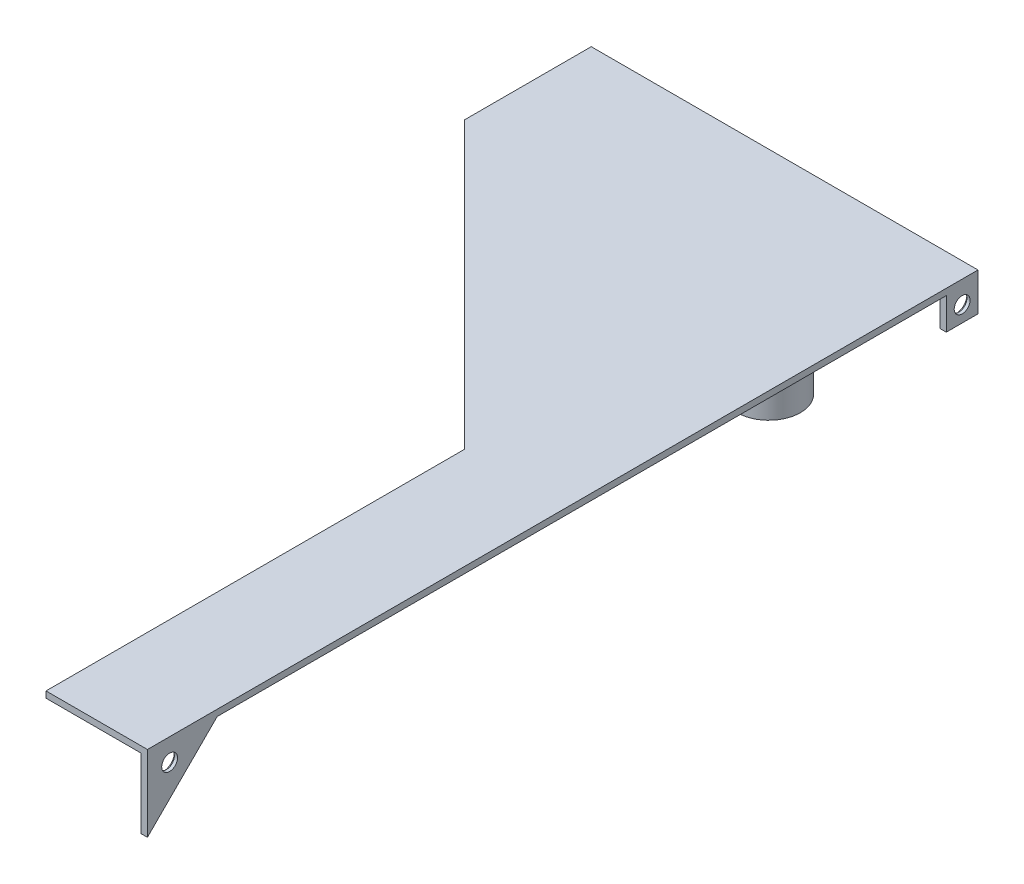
ISO-10303-21;
HEADER;
FILE_DESCRIPTION(('STEP AP214'),'2;1');
FILE_NAME('part.step','',(''),(''),'','','');
FILE_SCHEMA(('AUTOMOTIVE_DESIGN { 1 0 10303 214 1 1 1 1 }'));
ENDSEC;
DATA;
#1=APPLICATION_CONTEXT('core data for automotive mechanical design processes');
#2=APPLICATION_PROTOCOL_DEFINITION('international standard','automotive_design',2000,#1);
#3=PRODUCT_CONTEXT('',#1,'mechanical');
#4=PRODUCT('Part','Part','',(#3));
#5=PRODUCT_RELATED_PRODUCT_CATEGORY('part','',(#4));
#6=PRODUCT_DEFINITION_FORMATION('','',#4);
#7=PRODUCT_DEFINITION_CONTEXT('part definition',#1,'design');
#8=PRODUCT_DEFINITION('design','',#6,#7);
#9=PRODUCT_DEFINITION_SHAPE('','',#8);
#10=(LENGTH_UNIT() NAMED_UNIT(*) SI_UNIT(.MILLI.,.METRE.));
#11=(NAMED_UNIT(*) PLANE_ANGLE_UNIT() SI_UNIT($,.RADIAN.));
#12=(NAMED_UNIT(*) SI_UNIT($,.STERADIAN.) SOLID_ANGLE_UNIT());
#13=UNCERTAINTY_MEASURE_WITH_UNIT(LENGTH_MEASURE(1.E-05),#10,'distance_accuracy_value','');
#14=(GEOMETRIC_REPRESENTATION_CONTEXT(3) GLOBAL_UNCERTAINTY_ASSIGNED_CONTEXT((#13)) GLOBAL_UNIT_ASSIGNED_CONTEXT((#10,
#11,#12)) REPRESENTATION_CONTEXT('',''));
#15=CARTESIAN_POINT('',(0.,0.,0.));
#16=DIRECTION('',(0.,0.,1.));
#17=DIRECTION('',(1.,0.,0.));
#18=AXIS2_PLACEMENT_3D('',#15,#16,#17);
#19=CARTESIAN_POINT('',(0.,0.,0.));
#20=DIRECTION('',(-1.,0.,0.));
#21=DIRECTION('',(0.,0.,1.));
#22=AXIS2_PLACEMENT_3D('',#19,#20,#21);
#23=PLANE('',#22);
#24=DIRECTION('',(0.,-0.707106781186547,0.707106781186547));
#25=VECTOR('',#24,1.);
#26=CARTESIAN_POINT('',(0.,259.08,244.895433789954));
#27=LINE('',#26,#25);
#28=CARTESIAN_POINT('',(0.,259.08,244.895433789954));
#29=VERTEX_POINT('',#28);
#30=CARTESIAN_POINT('',(0.,231.139999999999,272.835433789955));
#31=VERTEX_POINT('',#30);
#32=EDGE_CURVE('E132',#29,#31,#27,.T.);
#33=ORIENTED_EDGE('',*,*,#32,.T.);
#34=DIRECTION('',(0.,-1.,0.));
#35=VECTOR('',#34,1.);
#36=CARTESIAN_POINT('',(0.,2.53999999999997,272.835433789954));
#37=LINE('',#36,#35);
#38=CARTESIAN_POINT('',(0.,259.08,272.835433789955));
#39=VERTEX_POINT('',#38);
#40=EDGE_CURVE('E141',#39,#31,#37,.T.);
#41=ORIENTED_EDGE('',*,*,#40,.F.);
#42=DIRECTION('',(0.,0.,-1.));
#43=VECTOR('',#42,1.);
#44=CARTESIAN_POINT('',(0.,259.08,272.835433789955));
#45=LINE('',#44,#43);
#46=EDGE_CURVE('E255',#39,#29,#45,.T.);
#47=ORIENTED_EDGE('',*,*,#46,.T.);
#48=EDGE_LOOP('',(#33,#41,#47));
#49=FACE_BOUND('',#48,.T.);
#50=CARTESIAN_POINT('',(0.,252.73,263.945433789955));
#51=DIRECTION('',(-1.,0.,0.));
#52=DIRECTION('',(0.,0.,1.));
#53=AXIS2_PLACEMENT_3D('',#50,#51,#52);
#54=CIRCLE('',#53,4.44500000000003);
#55=CARTESIAN_POINT('',(0.,252.73,268.390433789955));
#56=VERTEX_POINT('',#55);
#57=EDGE_CURVE('E177',#56,#56,#54,.F.);
#58=ORIENTED_EDGE('',*,*,#57,.T.);
#59=EDGE_LOOP('',(#58));
#60=FACE_BOUND('',#59,.T.);
#61=ADVANCED_FACE('F34',(#49,#60),#23,.T.);
#62=CARTESIAN_POINT('',(0.,0.,272.835433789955));
#63=DIRECTION('',(0.,0.,1.));
#64=DIRECTION('',(1.,0.,0.));
#65=AXIS2_PLACEMENT_3D('',#62,#63,#64);
#66=PLANE('',#65);
#67=DIRECTION('',(-1.,0.,0.));
#68=VECTOR('',#67,1.);
#69=CARTESIAN_POINT('',(0.,231.139999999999,272.835433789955));
#70=LINE('',#69,#68);
#71=CARTESIAN_POINT('',(2.54,231.139999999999,272.835433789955));
#72=VERTEX_POINT('',#71);
#73=EDGE_CURVE('E125',#72,#31,#70,.T.);
#74=ORIENTED_EDGE('',*,*,#73,.F.);
#75=DIRECTION('',(0.,-1.,0.));
#76=VECTOR('',#75,1.);
#77=CARTESIAN_POINT('',(2.54,2.53999999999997,272.835433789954));
#78=LINE('',#77,#76);
#79=CARTESIAN_POINT('',(2.54,261.62,272.835433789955));
#80=VERTEX_POINT('',#79);
#81=EDGE_CURVE('E137',#80,#72,#78,.T.);
#82=ORIENTED_EDGE('',*,*,#81,.F.);
#83=DIRECTION('',(-1.,0.,0.));
#84=VECTOR('',#83,1.);
#85=CARTESIAN_POINT('',(43.18,261.62,272.835433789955));
#86=LINE('',#85,#84);
#87=CARTESIAN_POINT('',(-38.1,261.62,272.835433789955));
#88=VERTEX_POINT('',#87);
#89=EDGE_CURVE('E158',#80,#88,#86,.T.);
#90=ORIENTED_EDGE('',*,*,#89,.T.);
#91=DIRECTION('',(0.,1.,0.));
#92=VECTOR('',#91,1.);
#93=CARTESIAN_POINT('',(-38.1,259.08,272.835433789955));
#94=LINE('',#93,#92);
#95=CARTESIAN_POINT('',(-38.1,259.08,272.835433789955));
#96=VERTEX_POINT('',#95);
#97=EDGE_CURVE('E269',#96,#88,#94,.T.);
#98=ORIENTED_EDGE('',*,*,#97,.F.);
#99=DIRECTION('',(1.,0.,0.));
#100=VECTOR('',#99,1.);
#101=CARTESIAN_POINT('',(0.,259.08,272.835433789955));
#102=LINE('',#101,#100);
#103=EDGE_CURVE('E262',#96,#39,#102,.T.);
#104=ORIENTED_EDGE('',*,*,#103,.T.);
#105=ORIENTED_EDGE('',*,*,#40,.T.);
#106=EDGE_LOOP('',(#74,#82,#90,#98,#104,#105));
#107=FACE_BOUND('',#106,.T.);
#108=ADVANCED_FACE('F136',(#107),#66,.T.);
#109=CARTESIAN_POINT('',(2.54,0.,-34.5045662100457));
#110=DIRECTION('',(1.,0.,0.));
#111=DIRECTION('',(0.,0.,-1.));
#112=AXIS2_PLACEMENT_3D('',#109,#110,#111);
#113=PLANE('',#112);
#114=ORIENTED_EDGE('',*,*,#81,.T.);
#115=DIRECTION('',(0.,-0.707106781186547,0.707106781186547));
#116=VECTOR('',#115,1.);
#117=CARTESIAN_POINT('',(2.54,259.08,244.895433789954));
#118=LINE('',#117,#116);
#119=CARTESIAN_POINT('',(2.54,259.08,244.895433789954));
#120=VERTEX_POINT('',#119);
#121=EDGE_CURVE('E121',#120,#72,#118,.T.);
#122=ORIENTED_EDGE('',*,*,#121,.F.);
#123=DIRECTION('',(0.,0.,1.));
#124=VECTOR('',#123,1.);
#125=CARTESIAN_POINT('',(2.54,259.08,230.925433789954));
#126=LINE('',#125,#124);
#127=CARTESIAN_POINT('',(2.54,259.08,-47.2045662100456));
#128=VERTEX_POINT('',#127);
#129=EDGE_CURVE('E149',#128,#120,#126,.T.);
#130=ORIENTED_EDGE('',*,*,#129,.F.);
#131=DIRECTION('',(0.,-1.,0.));
#132=VECTOR('',#131,1.);
#133=CARTESIAN_POINT('',(2.54,259.08,-47.2045662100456));
#134=LINE('',#133,#132);
#135=CARTESIAN_POINT('',(2.54,246.38,-47.2045662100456));
#136=VERTEX_POINT('',#135);
#137=EDGE_CURVE('E247',#128,#136,#134,.T.);
#138=ORIENTED_EDGE('',*,*,#137,.T.);
#139=DIRECTION('',(0.,0.,-1.));
#140=VECTOR('',#139,1.);
#141=CARTESIAN_POINT('',(2.54,246.38,-59.9045662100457));
#142=LINE('',#141,#140);
#143=CARTESIAN_POINT('',(2.54,246.38,-59.9045662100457));
#144=VERTEX_POINT('',#143);
#145=EDGE_CURVE('E229',#136,#144,#142,.T.);
#146=ORIENTED_EDGE('',*,*,#145,.T.);
#147=DIRECTION('',(0.,1.,0.));
#148=VECTOR('',#147,1.);
#149=CARTESIAN_POINT('',(2.54,259.08,-59.9045662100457));
#150=LINE('',#149,#148);
#151=CARTESIAN_POINT('',(2.54,261.62,-59.9045662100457));
#152=VERTEX_POINT('',#151);
#153=EDGE_CURVE('E264',#144,#152,#150,.T.);
#154=ORIENTED_EDGE('',*,*,#153,.T.);
#155=DIRECTION('',(0.,0.,-1.));
#156=VECTOR('',#155,1.);
#157=CARTESIAN_POINT('',(2.54,261.62,7.07767178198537E-13));
#158=LINE('',#157,#156);
#159=EDGE_CURVE('E148',#80,#152,#158,.T.);
#160=ORIENTED_EDGE('',*,*,#159,.F.);
#161=EDGE_LOOP('',(#114,#122,#130,#138,#146,#154,#160));
#162=FACE_BOUND('',#161,.T.);
#163=CARTESIAN_POINT('',(2.54,252.73,-53.5545662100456));
#164=DIRECTION('',(1.,0.,0.));
#165=DIRECTION('',(0.,0.,-1.));
#166=AXIS2_PLACEMENT_3D('',#163,#164,#165);
#167=CIRCLE('',#166,3.175);
#168=CARTESIAN_POINT('',(2.54,252.73,-56.7295662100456));
#169=VERTEX_POINT('',#168);
#170=EDGE_CURVE('E142',#169,#169,#167,.T.);
#171=ORIENTED_EDGE('',*,*,#170,.F.);
#172=EDGE_LOOP('',(#171));
#173=FACE_BOUND('',#172,.T.);
#174=CARTESIAN_POINT('',(2.54,252.73,263.945433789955));
#175=DIRECTION('',(1.,0.,0.));
#176=DIRECTION('',(0.,0.,-1.));
#177=AXIS2_PLACEMENT_3D('',#174,#175,#176);
#178=CIRCLE('',#177,3.17499999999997);
#179=CARTESIAN_POINT('',(2.54,252.73,260.770433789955));
#180=VERTEX_POINT('',#179);
#181=EDGE_CURVE('E250',#180,#180,#178,.T.);
#182=ORIENTED_EDGE('',*,*,#181,.F.);
#183=EDGE_LOOP('',(#182));
#184=FACE_BOUND('',#183,.T.);
#185=ADVANCED_FACE('F145',(#162,#173,#184),#113,.T.);
#186=CARTESIAN_POINT('',(2.54,259.08,244.895433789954));
#187=DIRECTION('',(0.,-0.707106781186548,-0.707106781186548));
#188=DIRECTION('',(0.,0.707106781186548,-0.707106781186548));
#189=AXIS2_PLACEMENT_3D('',#186,#187,#188);
#190=PLANE('',#189);
#191=ORIENTED_EDGE('',*,*,#121,.T.);
#192=ORIENTED_EDGE('',*,*,#73,.T.);
#193=ORIENTED_EDGE('',*,*,#32,.F.);
#194=DIRECTION('',(-1.,0.,0.));
#195=VECTOR('',#194,1.);
#196=CARTESIAN_POINT('',(2.54,259.08,244.895433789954));
#197=LINE('',#196,#195);
#198=EDGE_CURVE('E128',#120,#29,#197,.T.);
#199=ORIENTED_EDGE('',*,*,#198,.F.);
#200=EDGE_LOOP('',(#191,#192,#193,#199));
#201=FACE_BOUND('',#200,.T.);
#202=ADVANCED_FACE('F123',(#201),#190,.T.);
#203=CARTESIAN_POINT('',(-152.4,259.08,-9.10456621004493));
#204=DIRECTION('',(0.707106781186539,0.,-0.707106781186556));
#205=DIRECTION('',(-0.707106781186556,0.,-0.707106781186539));
#206=AXIS2_PLACEMENT_3D('',#203,#204,#205);
#207=PLANE('',#206);
#208=DIRECTION('',(-0.707106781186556,0.,-0.707106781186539));
#209=VECTOR('',#208,1.);
#210=CARTESIAN_POINT('',(-152.4,259.08,-9.10456621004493));
#211=LINE('',#210,#209);
#212=CARTESIAN_POINT('',(-38.1,259.08,105.195433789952));
#213=VERTEX_POINT('',#212);
#214=CARTESIAN_POINT('',(-152.4,259.08,-9.10456621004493));
#215=VERTEX_POINT('',#214);
#216=EDGE_CURVE('E58',#213,#215,#211,.T.);
#217=ORIENTED_EDGE('',*,*,#216,.F.);
#218=DIRECTION('',(0.,1.,0.));
#219=VECTOR('',#218,1.);
#220=CARTESIAN_POINT('',(-38.1,259.08,105.195433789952));
#221=LINE('',#220,#219);
#222=CARTESIAN_POINT('',(-38.1,261.62,105.195433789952));
#223=VERTEX_POINT('',#222);
#224=EDGE_CURVE('E152',#213,#223,#221,.T.);
#225=ORIENTED_EDGE('',*,*,#224,.T.);
#226=DIRECTION('',(-0.707106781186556,0.,-0.707106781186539));
#227=VECTOR('',#226,1.);
#228=CARTESIAN_POINT('',(-152.4,261.62,-9.10456621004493));
#229=LINE('',#228,#227);
#230=CARTESIAN_POINT('',(-152.4,261.62,-9.10456621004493));
#231=VERTEX_POINT('',#230);
#232=EDGE_CURVE('E163',#223,#231,#229,.T.);
#233=ORIENTED_EDGE('',*,*,#232,.T.);
#234=DIRECTION('',(0.,1.,0.));
#235=VECTOR('',#234,1.);
#236=CARTESIAN_POINT('',(-152.4,259.08,-9.10456621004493));
#237=LINE('',#236,#235);
#238=EDGE_CURVE('E165',#215,#231,#237,.T.);
#239=ORIENTED_EDGE('',*,*,#238,.F.);
#240=EDGE_LOOP('',(#217,#225,#233,#239));
#241=FACE_BOUND('',#240,.T.);
#242=ADVANCED_FACE('F278',(#241),#207,.F.);
#243=CARTESIAN_POINT('',(-152.4,259.08,-34.5045662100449));
#244=DIRECTION('',(1.,0.,0.));
#245=DIRECTION('',(0.,0.,-1.));
#246=AXIS2_PLACEMENT_3D('',#243,#244,#245);
#247=PLANE('',#246);
#248=DIRECTION('',(0.,0.,-1.));
#249=VECTOR('',#248,1.);
#250=CARTESIAN_POINT('',(-152.4,261.62,-34.5045662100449));
#251=LINE('',#250,#249);
#252=CARTESIAN_POINT('',(-152.4,261.62,-59.9045662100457));
#253=VERTEX_POINT('',#252);
#254=EDGE_CURVE('E160',#231,#253,#251,.T.);
#255=ORIENTED_EDGE('',*,*,#254,.T.);
#256=DIRECTION('',(0.,1.,0.));
#257=VECTOR('',#256,1.);
#258=CARTESIAN_POINT('',(-152.4,259.08,-59.9045662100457));
#259=LINE('',#258,#257);
#260=CARTESIAN_POINT('',(-152.4,259.08,-59.9045662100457));
#261=VERTEX_POINT('',#260);
#262=EDGE_CURVE('E272',#261,#253,#259,.T.);
#263=ORIENTED_EDGE('',*,*,#262,.F.);
#264=DIRECTION('',(0.,0.,-1.));
#265=VECTOR('',#264,1.);
#266=CARTESIAN_POINT('',(-152.4,259.08,-34.5045662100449));
#267=LINE('',#266,#265);
#268=EDGE_CURVE('E161',#215,#261,#267,.T.);
#269=ORIENTED_EDGE('',*,*,#268,.F.);
#270=ORIENTED_EDGE('',*,*,#238,.T.);
#271=EDGE_LOOP('',(#255,#263,#269,#270));
#272=FACE_BOUND('',#271,.T.);
#273=ADVANCED_FACE('F287',(#272),#247,.F.);
#274=CARTESIAN_POINT('',(0.,261.62,7.07767178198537E-13));
#275=DIRECTION('',(0.,1.,0.));
#276=DIRECTION('',(0.,0.,1.));
#277=AXIS2_PLACEMENT_3D('',#274,#275,#276);
#278=PLANE('',#277);
#279=ORIENTED_EDGE('',*,*,#232,.F.);
#280=DIRECTION('',(0.,0.,1.));
#281=VECTOR('',#280,1.);
#282=CARTESIAN_POINT('',(-38.1,261.62,272.835433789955));
#283=LINE('',#282,#281);
#284=EDGE_CURVE('E258',#223,#88,#283,.T.);
#285=ORIENTED_EDGE('',*,*,#284,.T.);
#286=ORIENTED_EDGE('',*,*,#89,.F.);
#287=ORIENTED_EDGE('',*,*,#159,.T.);
#288=DIRECTION('',(-1.,0.,0.));
#289=VECTOR('',#288,1.);
#290=CARTESIAN_POINT('',(2.54,261.62,-59.9045662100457));
#291=LINE('',#290,#289);
#292=EDGE_CURVE('E253',#152,#253,#291,.T.);
#293=ORIENTED_EDGE('',*,*,#292,.T.);
#294=ORIENTED_EDGE('',*,*,#254,.F.);
#295=EDGE_LOOP('',(#279,#285,#286,#287,#293,#294));
#296=FACE_BOUND('',#295,.T.);
#297=ADVANCED_FACE('F283',(#296),#278,.T.);
#298=CARTESIAN_POINT('',(0.,259.08,7.07767178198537E-13));
#299=DIRECTION('',(0.,1.,0.));
#300=DIRECTION('',(0.,0.,1.));
#301=AXIS2_PLACEMENT_3D('',#298,#299,#300);
#302=PLANE('',#301);
#303=CARTESIAN_POINT('',(-27.94,259.08,-6.56456621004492));
#304=DIRECTION('',(0.,1.,0.));
#305=DIRECTION('',(0.,0.,1.));
#306=AXIS2_PLACEMENT_3D('',#303,#304,#305);
#307=CIRCLE('',#306,12.7);
#308=CARTESIAN_POINT('',(-27.94,259.08,6.13543378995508));
#309=VERTEX_POINT('',#308);
#310=EDGE_CURVE('E11',#309,#309,#307,.F.);
#311=ORIENTED_EDGE('',*,*,#310,.F.);
#312=EDGE_LOOP('',(#311));
#313=FACE_BOUND('',#312,.T.);
#314=DIRECTION('',(0.,0.,1.));
#315=VECTOR('',#314,1.);
#316=CARTESIAN_POINT('',(0.,259.08,-59.9045662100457));
#317=LINE('',#316,#315);
#318=CARTESIAN_POINT('',(0.,259.08,-59.9045662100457));
#319=VERTEX_POINT('',#318);
#320=CARTESIAN_POINT('',(0.,259.08,-47.2045662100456));
#321=VERTEX_POINT('',#320);
#322=EDGE_CURVE('E227',#319,#321,#317,.T.);
#323=ORIENTED_EDGE('',*,*,#322,.T.);
#324=DIRECTION('',(1.,0.,0.));
#325=VECTOR('',#324,1.);
#326=CARTESIAN_POINT('',(0.,259.08,-47.2045662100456));
#327=LINE('',#326,#325);
#328=EDGE_CURVE('E239',#321,#128,#327,.T.);
#329=ORIENTED_EDGE('',*,*,#328,.T.);
#330=ORIENTED_EDGE('',*,*,#129,.T.);
#331=ORIENTED_EDGE('',*,*,#198,.T.);
#332=ORIENTED_EDGE('',*,*,#46,.F.);
#333=ORIENTED_EDGE('',*,*,#103,.F.);
#334=DIRECTION('',(0.,0.,1.));
#335=VECTOR('',#334,1.);
#336=CARTESIAN_POINT('',(-38.1,259.08,272.835433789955));
#337=LINE('',#336,#335);
#338=EDGE_CURVE('E260',#213,#96,#337,.T.);
#339=ORIENTED_EDGE('',*,*,#338,.F.);
#340=ORIENTED_EDGE('',*,*,#216,.T.);
#341=ORIENTED_EDGE('',*,*,#268,.T.);
#342=DIRECTION('',(-1.,0.,0.));
#343=VECTOR('',#342,1.);
#344=CARTESIAN_POINT('',(2.54,259.08,-59.9045662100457));
#345=LINE('',#344,#343);
#346=EDGE_CURVE('E257',#319,#261,#345,.T.);
#347=ORIENTED_EDGE('',*,*,#346,.F.);
#348=EDGE_LOOP('',(#323,#329,#330,#331,#332,#333,#339,#340,#341,#347));
#349=FACE_BOUND('',#348,.T.);
#350=ADVANCED_FACE('F199',(#313,#349),#302,.F.);
#351=CARTESIAN_POINT('',(-38.1,259.08,272.835433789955));
#352=DIRECTION('',(-1.,0.,0.));
#353=DIRECTION('',(0.,0.,1.));
#354=AXIS2_PLACEMENT_3D('',#351,#352,#353);
#355=PLANE('',#354);
#356=ORIENTED_EDGE('',*,*,#224,.F.);
#357=ORIENTED_EDGE('',*,*,#338,.T.);
#358=ORIENTED_EDGE('',*,*,#97,.T.);
#359=ORIENTED_EDGE('',*,*,#284,.F.);
#360=EDGE_LOOP('',(#356,#357,#358,#359));
#361=FACE_BOUND('',#360,.T.);
#362=ADVANCED_FACE('F290',(#361),#355,.T.);
#363=CARTESIAN_POINT('',(2.54,259.08,-59.9045662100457));
#364=DIRECTION('',(0.,0.,-1.));
#365=DIRECTION('',(-1.,0.,0.));
#366=AXIS2_PLACEMENT_3D('',#363,#364,#365);
#367=PLANE('',#366);
#368=ORIENTED_EDGE('',*,*,#292,.F.);
#369=ORIENTED_EDGE('',*,*,#153,.F.);
#370=DIRECTION('',(1.,0.,0.));
#371=VECTOR('',#370,1.);
#372=CARTESIAN_POINT('',(0.,246.38,-59.9045662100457));
#373=LINE('',#372,#371);
#374=CARTESIAN_POINT('',(0.,246.38,-59.9045662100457));
#375=VERTEX_POINT('',#374);
#376=EDGE_CURVE('E235',#375,#144,#373,.T.);
#377=ORIENTED_EDGE('',*,*,#376,.F.);
#378=DIRECTION('',(0.,1.,0.));
#379=VECTOR('',#378,1.);
#380=CARTESIAN_POINT('',(0.,259.08,-59.9045662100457));
#381=LINE('',#380,#379);
#382=EDGE_CURVE('E50',#375,#319,#381,.T.);
#383=ORIENTED_EDGE('',*,*,#382,.T.);
#384=ORIENTED_EDGE('',*,*,#346,.T.);
#385=ORIENTED_EDGE('',*,*,#262,.T.);
#386=EDGE_LOOP('',(#368,#369,#377,#383,#384,#385));
#387=FACE_BOUND('',#386,.T.);
#388=ADVANCED_FACE('F288',(#387),#367,.T.);
#389=CARTESIAN_POINT('',(0.,246.38,-59.9045662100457));
#390=DIRECTION('',(0.,-1.,0.));
#391=DIRECTION('',(0.,0.,-1.));
#392=AXIS2_PLACEMENT_3D('',#389,#390,#391);
#393=PLANE('',#392);
#394=ORIENTED_EDGE('',*,*,#145,.F.);
#395=DIRECTION('',(1.,0.,0.));
#396=VECTOR('',#395,1.);
#397=CARTESIAN_POINT('',(0.,246.38,-47.2045662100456));
#398=LINE('',#397,#396);
#399=CARTESIAN_POINT('',(0.,246.38,-47.2045662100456));
#400=VERTEX_POINT('',#399);
#401=EDGE_CURVE('E237',#400,#136,#398,.T.);
#402=ORIENTED_EDGE('',*,*,#401,.F.);
#403=DIRECTION('',(0.,0.,-1.));
#404=VECTOR('',#403,1.);
#405=CARTESIAN_POINT('',(0.,246.38,-59.9045662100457));
#406=LINE('',#405,#404);
#407=EDGE_CURVE('E225',#400,#375,#406,.T.);
#408=ORIENTED_EDGE('',*,*,#407,.T.);
#409=ORIENTED_EDGE('',*,*,#376,.T.);
#410=EDGE_LOOP('',(#394,#402,#408,#409));
#411=FACE_BOUND('',#410,.T.);
#412=ADVANCED_FACE('F234',(#411),#393,.T.);
#413=CARTESIAN_POINT('',(0.,259.08,-47.2045662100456));
#414=DIRECTION('',(0.,0.,1.));
#415=DIRECTION('',(0.,-1.,0.));
#416=AXIS2_PLACEMENT_3D('',#413,#414,#415);
#417=PLANE('',#416);
#418=ORIENTED_EDGE('',*,*,#137,.F.);
#419=ORIENTED_EDGE('',*,*,#328,.F.);
#420=DIRECTION('',(0.,-1.,0.));
#421=VECTOR('',#420,1.);
#422=CARTESIAN_POINT('',(0.,259.08,-47.2045662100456));
#423=LINE('',#422,#421);
#424=EDGE_CURVE('E240',#321,#400,#423,.T.);
#425=ORIENTED_EDGE('',*,*,#424,.T.);
#426=ORIENTED_EDGE('',*,*,#401,.T.);
#427=EDGE_LOOP('',(#418,#419,#425,#426));
#428=FACE_BOUND('',#427,.T.);
#429=ADVANCED_FACE('F220',(#428),#417,.T.);
#430=CARTESIAN_POINT('',(0.,0.,0.));
#431=DIRECTION('',(-1.,0.,0.));
#432=DIRECTION('',(0.,0.,1.));
#433=AXIS2_PLACEMENT_3D('',#430,#431,#432);
#434=PLANE('',#433);
#435=CARTESIAN_POINT('',(0.,252.73,-53.5545662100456));
#436=DIRECTION('',(-1.,0.,0.));
#437=DIRECTION('',(0.,0.,1.));
#438=AXIS2_PLACEMENT_3D('',#435,#436,#437);
#439=CIRCLE('',#438,4.44499999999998);
#440=CARTESIAN_POINT('',(0.,252.73,-49.1095662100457));
#441=VERTEX_POINT('',#440);
#442=EDGE_CURVE('E171',#441,#441,#439,.F.);
#443=ORIENTED_EDGE('',*,*,#442,.T.);
#444=EDGE_LOOP('',(#443));
#445=FACE_BOUND('',#444,.T.);
#446=ORIENTED_EDGE('',*,*,#382,.F.);
#447=ORIENTED_EDGE('',*,*,#407,.F.);
#448=ORIENTED_EDGE('',*,*,#424,.F.);
#449=ORIENTED_EDGE('',*,*,#322,.F.);
#450=EDGE_LOOP('',(#446,#447,#448,#449));
#451=FACE_BOUND('',#450,.T.);
#452=ADVANCED_FACE('F217',(#445,#451),#434,.T.);
#453=CARTESIAN_POINT('',(0.,252.73,-53.5545662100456));
#454=DIRECTION('',(1.,0.,0.));
#455=DIRECTION('',(0.,0.,-1.));
#456=AXIS2_PLACEMENT_3D('',#453,#454,#455);
#457=CYLINDRICAL_SURFACE('',#456,3.175);
#458=CARTESIAN_POINT('',(1.26999999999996,252.73,-53.5545662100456));
#459=DIRECTION('',(-1.,0.,0.));
#460=DIRECTION('',(0.,0.,1.));
#461=AXIS2_PLACEMENT_3D('',#458,#459,#460);
#462=CIRCLE('',#461,3.175);
#463=CARTESIAN_POINT('',(1.26999999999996,252.73,-50.3795662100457));
#464=VERTEX_POINT('',#463);
#465=EDGE_CURVE('E174',#464,#464,#462,.T.);
#466=ORIENTED_EDGE('',*,*,#465,.T.);
#467=EDGE_LOOP('',(#466));
#468=FACE_BOUND('',#467,.T.);
#469=ORIENTED_EDGE('',*,*,#170,.T.);
#470=EDGE_LOOP('',(#469));
#471=FACE_BOUND('',#470,.T.);
#472=ADVANCED_FACE('F211',(#468,#471),#457,.F.);
#473=CARTESIAN_POINT('',(0.,252.73,263.945433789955));
#474=DIRECTION('',(1.,0.,0.));
#475=DIRECTION('',(0.,0.,-1.));
#476=AXIS2_PLACEMENT_3D('',#473,#474,#475);
#477=CYLINDRICAL_SURFACE('',#476,3.17499999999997);
#478=CARTESIAN_POINT('',(1.27000000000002,252.73,263.945433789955));
#479=DIRECTION('',(-1.,0.,0.));
#480=DIRECTION('',(0.,0.,1.));
#481=AXIS2_PLACEMENT_3D('',#478,#479,#480);
#482=CIRCLE('',#481,3.17499999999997);
#483=CARTESIAN_POINT('',(1.27000000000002,252.73,267.120433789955));
#484=VERTEX_POINT('',#483);
#485=EDGE_CURVE('E43',#484,#484,#482,.T.);
#486=ORIENTED_EDGE('',*,*,#485,.T.);
#487=EDGE_LOOP('',(#486));
#488=FACE_BOUND('',#487,.T.);
#489=ORIENTED_EDGE('',*,*,#181,.T.);
#490=EDGE_LOOP('',(#489));
#491=FACE_BOUND('',#490,.T.);
#492=ADVANCED_FACE('F182',(#488,#491),#477,.F.);
#493=CARTESIAN_POINT('',(0.,252.73,-53.5545662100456));
#494=DIRECTION('',(-1.,0.,0.));
#495=DIRECTION('',(0.,0.,1.));
#496=AXIS2_PLACEMENT_3D('',#493,#494,#495);
#497=CONICAL_SURFACE('',#496,4.44499999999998,0.785398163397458);
#498=ORIENTED_EDGE('',*,*,#465,.F.);
#499=EDGE_LOOP('',(#498));
#500=FACE_BOUND('',#499,.T.);
#501=ORIENTED_EDGE('',*,*,#442,.F.);
#502=EDGE_LOOP('',(#501));
#503=FACE_BOUND('',#502,.T.);
#504=ADVANCED_FACE('F188',(#500,#503),#497,.F.);
#505=CARTESIAN_POINT('',(0.,252.73,263.945433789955));
#506=DIRECTION('',(-1.,0.,0.));
#507=DIRECTION('',(0.,0.,1.));
#508=AXIS2_PLACEMENT_3D('',#505,#506,#507);
#509=CONICAL_SURFACE('',#508,4.44500000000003,0.785398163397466);
#510=ORIENTED_EDGE('',*,*,#485,.F.);
#511=EDGE_LOOP('',(#510));
#512=FACE_BOUND('',#511,.T.);
#513=ORIENTED_EDGE('',*,*,#57,.F.);
#514=EDGE_LOOP('',(#513));
#515=FACE_BOUND('',#514,.T.);
#516=ADVANCED_FACE('F37',(#512,#515),#509,.F.);
#517=CARTESIAN_POINT('',(-27.94,229.87,-6.56456621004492));
#518=DIRECTION('',(0.,1.,0.));
#519=DIRECTION('',(0.,0.,1.));
#520=AXIS2_PLACEMENT_3D('',#517,#518,#519);
#521=CYLINDRICAL_SURFACE('',#520,12.7);
#522=CARTESIAN_POINT('',(-27.94,229.87,-6.56456621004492));
#523=DIRECTION('',(0.,-1.,0.));
#524=DIRECTION('',(0.,0.,-1.));
#525=AXIS2_PLACEMENT_3D('',#522,#523,#524);
#526=CIRCLE('',#525,12.7);
#527=CARTESIAN_POINT('',(-27.94,229.87,6.13543378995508));
#528=VERTEX_POINT('',#527);
#529=EDGE_CURVE('E143',#528,#528,#526,.T.);
#530=CARTESIAN_POINT('',(-27.94,229.87,6.13543378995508));
#531=CARTESIAN_POINT('',(-27.94,230.174270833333,6.13543378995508));
#532=CARTESIAN_POINT('',(-27.94,230.478541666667,6.13543378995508));
#533=CARTESIAN_POINT('',(-27.94,231.087083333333,6.13543378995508));
#534=CARTESIAN_POINT('',(-27.94,231.391354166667,6.13543378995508));
#535=CARTESIAN_POINT('',(-27.94,231.999895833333,6.13543378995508));
#536=CARTESIAN_POINT('',(-27.94,232.304166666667,6.13543378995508));
#537=CARTESIAN_POINT('',(-27.94,232.912708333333,6.13543378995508));
#538=CARTESIAN_POINT('',(-27.94,233.216979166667,6.13543378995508));
#539=CARTESIAN_POINT('',(-27.94,233.825520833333,6.13543378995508));
#540=CARTESIAN_POINT('',(-27.94,234.129791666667,6.13543378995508));
#541=CARTESIAN_POINT('',(-27.94,234.738333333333,6.13543378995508));
#542=CARTESIAN_POINT('',(-27.94,235.042604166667,6.13543378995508));
#543=CARTESIAN_POINT('',(-27.94,235.651145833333,6.13543378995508));
#544=CARTESIAN_POINT('',(-27.94,235.955416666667,6.13543378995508));
#545=CARTESIAN_POINT('',(-27.94,236.563958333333,6.13543378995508));
#546=CARTESIAN_POINT('',(-27.94,236.868229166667,6.13543378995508));
#547=CARTESIAN_POINT('',(-27.94,237.476770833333,6.13543378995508));
#548=CARTESIAN_POINT('',(-27.94,237.781041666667,6.13543378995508));
#549=CARTESIAN_POINT('',(-27.94,238.389583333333,6.13543378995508));
#550=CARTESIAN_POINT('',(-27.94,238.693854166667,6.13543378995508));
#551=CARTESIAN_POINT('',(-27.94,239.302395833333,6.13543378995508));
#552=CARTESIAN_POINT('',(-27.94,239.606666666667,6.13543378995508));
#553=CARTESIAN_POINT('',(-27.94,240.215208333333,6.13543378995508));
#554=CARTESIAN_POINT('',(-27.94,240.519479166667,6.13543378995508));
#555=CARTESIAN_POINT('',(-27.94,241.128020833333,6.13543378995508));
#556=CARTESIAN_POINT('',(-27.94,241.432291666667,6.13543378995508));
#557=CARTESIAN_POINT('',(-27.94,242.040833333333,6.13543378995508));
#558=CARTESIAN_POINT('',(-27.94,242.345104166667,6.13543378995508));
#559=CARTESIAN_POINT('',(-27.94,242.953645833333,6.13543378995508));
#560=CARTESIAN_POINT('',(-27.94,243.257916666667,6.13543378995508));
#561=CARTESIAN_POINT('',(-27.94,243.866458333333,6.13543378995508));
#562=CARTESIAN_POINT('',(-27.94,244.170729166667,6.13543378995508));
#563=CARTESIAN_POINT('',(-27.94,244.779270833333,6.13543378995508));
#564=CARTESIAN_POINT('',(-27.94,245.083541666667,6.13543378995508));
#565=CARTESIAN_POINT('',(-27.94,245.692083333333,6.13543378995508));
#566=CARTESIAN_POINT('',(-27.94,245.996354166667,6.13543378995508));
#567=CARTESIAN_POINT('',(-27.94,246.604895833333,6.13543378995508));
#568=CARTESIAN_POINT('',(-27.94,246.909166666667,6.13543378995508));
#569=CARTESIAN_POINT('',(-27.94,247.517708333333,6.13543378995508));
#570=CARTESIAN_POINT('',(-27.94,247.821979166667,6.13543378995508));
#571=CARTESIAN_POINT('',(-27.94,248.430520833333,6.13543378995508));
#572=CARTESIAN_POINT('',(-27.94,248.734791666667,6.13543378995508));
#573=CARTESIAN_POINT('',(-27.94,249.343333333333,6.13543378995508));
#574=CARTESIAN_POINT('',(-27.94,249.647604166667,6.13543378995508));
#575=CARTESIAN_POINT('',(-27.94,250.256145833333,6.13543378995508));
#576=CARTESIAN_POINT('',(-27.94,250.560416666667,6.13543378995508));
#577=CARTESIAN_POINT('',(-27.94,251.168958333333,6.13543378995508));
#578=CARTESIAN_POINT('',(-27.94,251.473229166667,6.13543378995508));
#579=CARTESIAN_POINT('',(-27.94,252.081770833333,6.13543378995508));
#580=CARTESIAN_POINT('',(-27.94,252.386041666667,6.13543378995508));
#581=CARTESIAN_POINT('',(-27.94,252.994583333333,6.13543378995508));
#582=CARTESIAN_POINT('',(-27.94,253.298854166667,6.13543378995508));
#583=CARTESIAN_POINT('',(-27.94,253.907395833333,6.13543378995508));
#584=CARTESIAN_POINT('',(-27.94,254.211666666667,6.13543378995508));
#585=CARTESIAN_POINT('',(-27.94,254.820208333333,6.13543378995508));
#586=CARTESIAN_POINT('',(-27.94,255.124479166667,6.13543378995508));
#587=CARTESIAN_POINT('',(-27.94,255.733020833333,6.13543378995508));
#588=CARTESIAN_POINT('',(-27.94,256.037291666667,6.13543378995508));
#589=CARTESIAN_POINT('',(-27.94,256.645833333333,6.13543378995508));
#590=CARTESIAN_POINT('',(-27.94,256.950104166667,6.13543378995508));
#591=CARTESIAN_POINT('',(-27.94,257.558645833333,6.13543378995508));
#592=CARTESIAN_POINT('',(-27.94,257.862916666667,6.13543378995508));
#593=CARTESIAN_POINT('',(-27.94,258.471458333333,6.13543378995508));
#594=CARTESIAN_POINT('',(-27.94,258.775729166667,6.13543378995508));
#595=CARTESIAN_POINT('',(-27.94,259.08,6.13543378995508));
#596=B_SPLINE_CURVE_WITH_KNOTS('',3,(#530,#531,#532,#533,#534,#535,#536,#537,#538,#539,#540,
#541,#542,#543,#544,#545,#546,#547,#548,#549,#550,#551,#552,#553,#554,#555,#556,#557,#558,#559,
#560,#561,#562,#563,#564,#565,#566,#567,#568,#569,#570,#571,#572,#573,#574,#575,#576,#577,#578,
#579,#580,#581,#582,#583,#584,#585,#586,#587,#588,#589,#590,#591,#592,#593,#594,#595),
.UNSPECIFIED.,.F.,.F.,(4,2,2,2,2,2,2,2,2,2,2,2,2,2,2,2,2,2,2,2,2,2,2,2,2,2,2,2,2,2,2,2,4),(0.,
0.912812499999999,1.825625,2.7384375,3.65124999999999,4.56406249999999,5.47687499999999,
6.38968749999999,7.30249999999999,8.21531249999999,9.12812499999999,10.0409375,10.95375,
11.8665625,12.779375,13.6921875,14.605,15.5178125,16.430625,17.3434375,18.25625,19.1690625,
20.081875,20.9946875,21.9075,22.8203125,23.7331249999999,24.6459375,25.5587499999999,26.4715625,
27.3843749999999,28.2971875,29.2099999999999),.UNSPECIFIED.);
#597=EDGE_CURVE('BSEAM187',#528,#309,#596,.T.);
#598=ORIENTED_EDGE('',*,*,#529,.F.);
#599=ORIENTED_EDGE('',*,*,#310,.T.);
#600=ORIENTED_EDGE('',*,*,#597,.T.);
#601=ORIENTED_EDGE('',*,*,#597,.F.);
#602=EDGE_LOOP('',(#598,#600,#599,#601));
#603=FACE_BOUND('',#602,.T.);
#604=ADVANCED_FACE('F187',(#603),#521,.T.);
#605=CARTESIAN_POINT('',(-27.94,229.87,-6.56456621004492));
#606=DIRECTION('',(0.,-1.,0.));
#607=DIRECTION('',(0.,0.,-1.));
#608=AXIS2_PLACEMENT_3D('',#605,#606,#607);
#609=PLANE('',#608);
#610=ORIENTED_EDGE('',*,*,#529,.T.);
#611=EDGE_LOOP('',(#610));
#612=FACE_BOUND('',#611,.T.);
#613=ADVANCED_FACE('F300',(#612),#609,.T.);
#614=CLOSED_SHELL('',(#61,#108,#185,#202,#242,#273,#297,#350,#362,#388,#412,#429,#452,#472,#492,
#504,#516,#604,#613));
#615=MANIFOLD_SOLID_BREP('B2',#614);
#616=ADVANCED_BREP_SHAPE_REPRESENTATION('',(#18,#615),#14);
#617=SHAPE_DEFINITION_REPRESENTATION(#9,#616);
ENDSEC;
END-ISO-10303-21;
